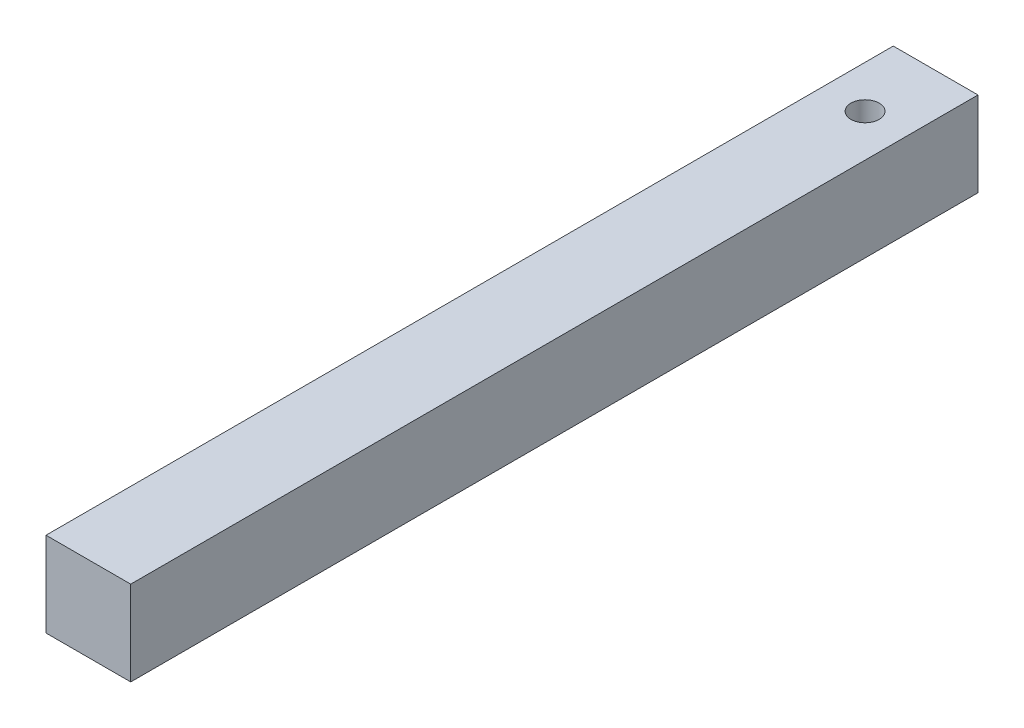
ISO-10303-21;
HEADER;
FILE_DESCRIPTION(('STEP AP214'),'2;1');
FILE_NAME('part.step','',(''),(''),'','','');
FILE_SCHEMA(('AUTOMOTIVE_DESIGN { 1 0 10303 214 1 1 1 1 }'));
ENDSEC;
DATA;
#1=APPLICATION_CONTEXT('core data for automotive mechanical design processes');
#2=APPLICATION_PROTOCOL_DEFINITION('international standard','automotive_design',2000,#1);
#3=PRODUCT_CONTEXT('',#1,'mechanical');
#4=PRODUCT('Part','Part','',(#3));
#5=PRODUCT_RELATED_PRODUCT_CATEGORY('part','',(#4));
#6=PRODUCT_DEFINITION_FORMATION('','',#4);
#7=PRODUCT_DEFINITION_CONTEXT('part definition',#1,'design');
#8=PRODUCT_DEFINITION('design','',#6,#7);
#9=PRODUCT_DEFINITION_SHAPE('','',#8);
#10=(LENGTH_UNIT() NAMED_UNIT(*) SI_UNIT(.MILLI.,.METRE.));
#11=(NAMED_UNIT(*) PLANE_ANGLE_UNIT() SI_UNIT($,.RADIAN.));
#12=(NAMED_UNIT(*) SI_UNIT($,.STERADIAN.) SOLID_ANGLE_UNIT());
#13=UNCERTAINTY_MEASURE_WITH_UNIT(LENGTH_MEASURE(1.E-05),#10,'distance_accuracy_value','');
#14=(GEOMETRIC_REPRESENTATION_CONTEXT(3) GLOBAL_UNCERTAINTY_ASSIGNED_CONTEXT((#13)) GLOBAL_UNIT_ASSIGNED_CONTEXT((#10,
#11,#12)) REPRESENTATION_CONTEXT('',''));
#15=CARTESIAN_POINT('',(0.,0.,0.));
#16=DIRECTION('',(0.,0.,1.));
#17=DIRECTION('',(1.,0.,0.));
#18=AXIS2_PLACEMENT_3D('',#15,#16,#17);
#19=CARTESIAN_POINT('',(9.52499999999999,19.05,-95.25));
#20=DIRECTION('',(-1.,0.,0.));
#21=DIRECTION('',(0.,0.,1.));
#22=AXIS2_PLACEMENT_3D('',#19,#20,#21);
#23=PLANE('',#22);
#24=DIRECTION('',(0.,0.,-1.));
#25=VECTOR('',#24,1.);
#26=CARTESIAN_POINT('',(9.52499999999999,0.,-95.25));
#27=LINE('',#26,#25);
#28=CARTESIAN_POINT('',(9.52500000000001,0.,95.25));
#29=VERTEX_POINT('',#28);
#30=CARTESIAN_POINT('',(9.52499999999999,0.,-95.25));
#31=VERTEX_POINT('',#30);
#32=EDGE_CURVE('E106',#29,#31,#27,.T.);
#33=ORIENTED_EDGE('',*,*,#32,.T.);
#34=DIRECTION('',(0.,-1.,0.));
#35=VECTOR('',#34,1.);
#36=CARTESIAN_POINT('',(9.52499999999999,19.05,-95.25));
#37=LINE('',#36,#35);
#38=CARTESIAN_POINT('',(9.52499999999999,19.05,-95.25));
#39=VERTEX_POINT('',#38);
#40=EDGE_CURVE('E11',#39,#31,#37,.T.);
#41=ORIENTED_EDGE('',*,*,#40,.F.);
#42=DIRECTION('',(0.,0.,-1.));
#43=VECTOR('',#42,1.);
#44=CARTESIAN_POINT('',(9.52499999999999,19.05,-95.25));
#45=LINE('',#44,#43);
#46=CARTESIAN_POINT('',(9.52500000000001,19.05,95.25));
#47=VERTEX_POINT('',#46);
#48=EDGE_CURVE('E93',#47,#39,#45,.T.);
#49=ORIENTED_EDGE('',*,*,#48,.F.);
#50=DIRECTION('',(0.,-1.,0.));
#51=VECTOR('',#50,1.);
#52=CARTESIAN_POINT('',(9.52500000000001,19.05,95.25));
#53=LINE('',#52,#51);
#54=EDGE_CURVE('E102',#47,#29,#53,.T.);
#55=ORIENTED_EDGE('',*,*,#54,.T.);
#56=EDGE_LOOP('',(#33,#41,#49,#55));
#57=FACE_BOUND('',#56,.T.);
#58=ADVANCED_FACE('F41',(#57),#23,.F.);
#59=CARTESIAN_POINT('',(-9.52500000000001,19.05,-95.25));
#60=DIRECTION('',(0.,0.,1.));
#61=DIRECTION('',(1.,0.,0.));
#62=AXIS2_PLACEMENT_3D('',#59,#60,#61);
#63=PLANE('',#62);
#64=DIRECTION('',(-1.,0.,0.));
#65=VECTOR('',#64,1.);
#66=CARTESIAN_POINT('',(-9.52500000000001,0.,-95.25));
#67=LINE('',#66,#65);
#68=CARTESIAN_POINT('',(-9.52500000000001,0.,-95.25));
#69=VERTEX_POINT('',#68);
#70=EDGE_CURVE('E97',#31,#69,#67,.T.);
#71=ORIENTED_EDGE('',*,*,#70,.T.);
#72=DIRECTION('',(0.,-1.,0.));
#73=VECTOR('',#72,1.);
#74=CARTESIAN_POINT('',(-9.52500000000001,19.05,-95.25));
#75=LINE('',#74,#73);
#76=CARTESIAN_POINT('',(-9.52500000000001,19.05,-95.25));
#77=VERTEX_POINT('',#76);
#78=EDGE_CURVE('E50',#77,#69,#75,.T.);
#79=ORIENTED_EDGE('',*,*,#78,.F.);
#80=DIRECTION('',(-1.,0.,0.));
#81=VECTOR('',#80,1.);
#82=CARTESIAN_POINT('',(-9.52500000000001,19.05,-95.25));
#83=LINE('',#82,#81);
#84=EDGE_CURVE('E88',#39,#77,#83,.T.);
#85=ORIENTED_EDGE('',*,*,#84,.F.);
#86=ORIENTED_EDGE('',*,*,#40,.T.);
#87=EDGE_LOOP('',(#71,#79,#85,#86));
#88=FACE_BOUND('',#87,.T.);
#89=ADVANCED_FACE('F96',(#88),#63,.F.);
#90=CARTESIAN_POINT('',(-9.52500000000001,19.05,-95.25));
#91=DIRECTION('',(1.,0.,0.));
#92=DIRECTION('',(0.,0.,-1.));
#93=AXIS2_PLACEMENT_3D('',#90,#91,#92);
#94=PLANE('',#93);
#95=DIRECTION('',(0.,0.,1.));
#96=VECTOR('',#95,1.);
#97=CARTESIAN_POINT('',(-9.52500000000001,0.,-95.25));
#98=LINE('',#97,#96);
#99=CARTESIAN_POINT('',(-9.52499999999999,0.,95.25));
#100=VERTEX_POINT('',#99);
#101=EDGE_CURVE('E75',#69,#100,#98,.T.);
#102=ORIENTED_EDGE('',*,*,#101,.T.);
#103=DIRECTION('',(0.,-1.,0.));
#104=VECTOR('',#103,1.);
#105=CARTESIAN_POINT('',(-9.52499999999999,19.05,95.25));
#106=LINE('',#105,#104);
#107=CARTESIAN_POINT('',(-9.52499999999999,19.05,95.25));
#108=VERTEX_POINT('',#107);
#109=EDGE_CURVE('E98',#108,#100,#106,.T.);
#110=ORIENTED_EDGE('',*,*,#109,.F.);
#111=DIRECTION('',(0.,0.,1.));
#112=VECTOR('',#111,1.);
#113=CARTESIAN_POINT('',(-9.52500000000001,19.05,-95.25));
#114=LINE('',#113,#112);
#115=EDGE_CURVE('E91',#77,#108,#114,.T.);
#116=ORIENTED_EDGE('',*,*,#115,.F.);
#117=ORIENTED_EDGE('',*,*,#78,.T.);
#118=EDGE_LOOP('',(#102,#110,#116,#117));
#119=FACE_BOUND('',#118,.T.);
#120=ADVANCED_FACE('F100',(#119),#94,.F.);
#121=CARTESIAN_POINT('',(-9.52499999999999,19.05,95.25));
#122=DIRECTION('',(0.,0.,-1.));
#123=DIRECTION('',(-1.,0.,0.));
#124=AXIS2_PLACEMENT_3D('',#121,#122,#123);
#125=PLANE('',#124);
#126=DIRECTION('',(1.,0.,0.));
#127=VECTOR('',#126,1.);
#128=CARTESIAN_POINT('',(-9.52499999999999,0.,95.25));
#129=LINE('',#128,#127);
#130=EDGE_CURVE('E81',#100,#29,#129,.T.);
#131=ORIENTED_EDGE('',*,*,#130,.T.);
#132=ORIENTED_EDGE('',*,*,#54,.F.);
#133=DIRECTION('',(1.,0.,0.));
#134=VECTOR('',#133,1.);
#135=CARTESIAN_POINT('',(-9.52499999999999,19.05,95.25));
#136=LINE('',#135,#134);
#137=EDGE_CURVE('E58',#108,#47,#136,.T.);
#138=ORIENTED_EDGE('',*,*,#137,.F.);
#139=ORIENTED_EDGE('',*,*,#109,.T.);
#140=EDGE_LOOP('',(#131,#132,#138,#139));
#141=FACE_BOUND('',#140,.T.);
#142=ADVANCED_FACE('F113',(#141),#125,.F.);
#143=CARTESIAN_POINT('',(0.,19.05,0.));
#144=DIRECTION('',(0.,1.,0.));
#145=DIRECTION('',(0.,0.,1.));
#146=AXIS2_PLACEMENT_3D('',#143,#144,#145);
#147=PLANE('',#146);
#148=CARTESIAN_POINT('',(0.,19.05,-79.375));
#149=DIRECTION('',(0.,1.,0.));
#150=DIRECTION('',(0.,0.,1.));
#151=AXIS2_PLACEMENT_3D('',#148,#149,#150);
#152=CIRCLE('',#151,3.175);
#153=CARTESIAN_POINT('',(0.,19.05,-76.2));
#154=VERTEX_POINT('',#153);
#155=EDGE_CURVE('E119',#154,#154,#152,.T.);
#156=ORIENTED_EDGE('',*,*,#155,.F.);
#157=EDGE_LOOP('',(#156));
#158=FACE_BOUND('',#157,.T.);
#159=ORIENTED_EDGE('',*,*,#48,.T.);
#160=ORIENTED_EDGE('',*,*,#84,.T.);
#161=ORIENTED_EDGE('',*,*,#115,.T.);
#162=ORIENTED_EDGE('',*,*,#137,.T.);
#163=EDGE_LOOP('',(#159,#160,#161,#162));
#164=FACE_BOUND('',#163,.T.);
#165=ADVANCED_FACE('F89',(#158,#164),#147,.T.);
#166=CARTESIAN_POINT('',(0.,0.,0.));
#167=DIRECTION('',(0.,1.,0.));
#168=DIRECTION('',(0.,0.,1.));
#169=AXIS2_PLACEMENT_3D('',#166,#167,#168);
#170=PLANE('',#169);
#171=CARTESIAN_POINT('',(0.,0.,-79.375));
#172=DIRECTION('',(0.,1.,0.));
#173=DIRECTION('',(0.,0.,1.));
#174=AXIS2_PLACEMENT_3D('',#171,#172,#173);
#175=CIRCLE('',#174,3.175);
#176=CARTESIAN_POINT('',(0.,0.,-76.2));
#177=VERTEX_POINT('',#176);
#178=EDGE_CURVE('E44',#177,#177,#175,.T.);
#179=ORIENTED_EDGE('',*,*,#178,.T.);
#180=EDGE_LOOP('',(#179));
#181=FACE_BOUND('',#180,.T.);
#182=ORIENTED_EDGE('',*,*,#32,.F.);
#183=ORIENTED_EDGE('',*,*,#130,.F.);
#184=ORIENTED_EDGE('',*,*,#101,.F.);
#185=ORIENTED_EDGE('',*,*,#70,.F.);
#186=EDGE_LOOP('',(#182,#183,#184,#185));
#187=FACE_BOUND('',#186,.T.);
#188=ADVANCED_FACE('F116',(#181,#187),#170,.F.);
#189=CARTESIAN_POINT('',(0.,-22.098,-79.375));
#190=DIRECTION('',(0.,1.,0.));
#191=DIRECTION('',(0.,0.,1.));
#192=AXIS2_PLACEMENT_3D('',#189,#190,#191);
#193=CYLINDRICAL_SURFACE('',#192,3.175);
#194=ORIENTED_EDGE('',*,*,#155,.T.);
#195=EDGE_LOOP('',(#194));
#196=FACE_BOUND('',#195,.T.);
#197=ORIENTED_EDGE('',*,*,#178,.F.);
#198=EDGE_LOOP('',(#197));
#199=FACE_BOUND('',#198,.T.);
#200=ADVANCED_FACE('F127',(#196,#199),#193,.F.);
#201=CLOSED_SHELL('',(#58,#89,#120,#142,#165,#188,#200));
#202=MANIFOLD_SOLID_BREP('B2',#201);
#203=ADVANCED_BREP_SHAPE_REPRESENTATION('',(#18,#202),#14);
#204=SHAPE_DEFINITION_REPRESENTATION(#9,#203);
ENDSEC;
END-ISO-10303-21;
